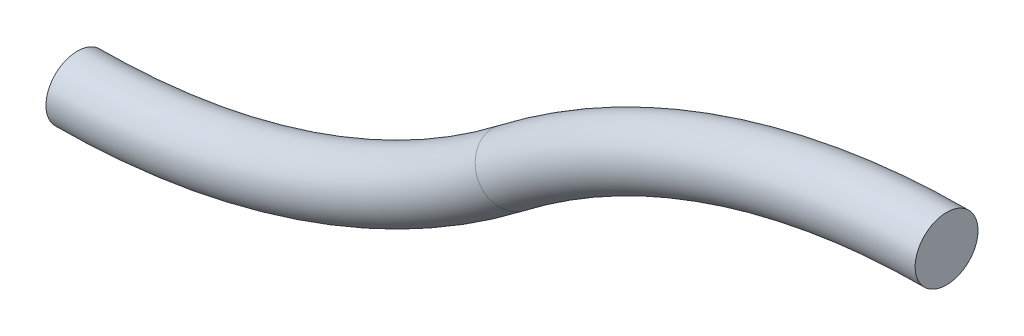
ISO-10303-21;
HEADER;
FILE_DESCRIPTION(('STEP AP214'),'2;1');
FILE_NAME('part.step','',(''),(''),'','','');
FILE_SCHEMA(('AUTOMOTIVE_DESIGN { 1 0 10303 214 1 1 1 1 }'));
ENDSEC;
DATA;
#1=APPLICATION_CONTEXT('core data for automotive mechanical design processes');
#2=APPLICATION_PROTOCOL_DEFINITION('international standard','automotive_design',2000,#1);
#3=PRODUCT_CONTEXT('',#1,'mechanical');
#4=PRODUCT('Part','Part','',(#3));
#5=PRODUCT_RELATED_PRODUCT_CATEGORY('part','',(#4));
#6=PRODUCT_DEFINITION_FORMATION('','',#4);
#7=PRODUCT_DEFINITION_CONTEXT('part definition',#1,'design');
#8=PRODUCT_DEFINITION('design','',#6,#7);
#9=PRODUCT_DEFINITION_SHAPE('','',#8);
#10=(LENGTH_UNIT() NAMED_UNIT(*) SI_UNIT(.MILLI.,.METRE.));
#11=(NAMED_UNIT(*) PLANE_ANGLE_UNIT() SI_UNIT($,.RADIAN.));
#12=(NAMED_UNIT(*) SI_UNIT($,.STERADIAN.) SOLID_ANGLE_UNIT());
#13=UNCERTAINTY_MEASURE_WITH_UNIT(LENGTH_MEASURE(1.E-05),#10,'distance_accuracy_value','');
#14=(GEOMETRIC_REPRESENTATION_CONTEXT(3) GLOBAL_UNCERTAINTY_ASSIGNED_CONTEXT((#13)) GLOBAL_UNIT_ASSIGNED_CONTEXT((#10,
#11,#12)) REPRESENTATION_CONTEXT('',''));
#15=CARTESIAN_POINT('',(0.,0.,0.));
#16=DIRECTION('',(0.,0.,1.));
#17=DIRECTION('',(1.,0.,0.));
#18=AXIS2_PLACEMENT_3D('',#15,#16,#17);
#19=CARTESIAN_POINT('',(109.7026,-52.9228681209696,0.));
#20=DIRECTION('',(0.,0.,-1.));
#21=DIRECTION('',(-1.,0.,0.));
#22=AXIS2_PLACEMENT_3D('',#19,#20,#21);
#23=TOROIDAL_SURFACE('',#22,90.1417615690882,3.96875);
#24=CARTESIAN_POINT('',(54.8513000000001,18.6094467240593,0.));
#25=DIRECTION('',(0.793553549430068,0.608500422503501,0.));
#26=DIRECTION('',(0.,0.,-1.));
#27=AXIS2_PLACEMENT_3D('',#24,#25,#26);
#28=CIRCLE('',#27,3.96875);
#29=CARTESIAN_POINT('',(52.4363139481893,21.7588623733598,0.));
#30=VERTEX_POINT('',#29);
#31=EDGE_CURVE('E34',#30,#30,#28,.T.);
#32=CARTESIAN_POINT('',(109.7026,37.2188934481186,0.));
#33=DIRECTION('',(1.,0.,0.));
#34=DIRECTION('',(0.,0.,-1.));
#35=AXIS2_PLACEMENT_3D('',#32,#33,#34);
#36=CIRCLE('',#35,3.96875);
#37=CARTESIAN_POINT('',(109.7026,41.1876434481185,0.));
#38=VERTEX_POINT('',#37);
#39=EDGE_CURVE('E10',#38,#38,#36,.T.);
#40=CARTESIAN_POINT('',(109.7026,-52.9228681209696,0.));
#41=DIRECTION('',(0.,0.,-1.));
#42=DIRECTION('',(-1.,0.,0.));
#43=AXIS2_PLACEMENT_3D('',#40,#41,#42);
#44=CIRCLE('',#43,94.1105115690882);
#45=EDGE_CURVE('',#30,#38,#44,.T.);
#46=ORIENTED_EDGE('',*,*,#31,.T.);
#47=ORIENTED_EDGE('',*,*,#39,.F.);
#48=ORIENTED_EDGE('',*,*,#45,.T.);
#49=ORIENTED_EDGE('',*,*,#45,.F.);
#50=EDGE_LOOP('',(#46,#48,#47,#49));
#51=FACE_BOUND('',#50,.T.);
#52=ADVANCED_FACE('F28',(#51),#23,.T.);
#53=CARTESIAN_POINT('',(0.,90.1417615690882,-1.07552855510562E-13));
#54=DIRECTION('',(0.,0.,-1.));
#55=DIRECTION('',(-1.,0.,0.));
#56=AXIS2_PLACEMENT_3D('',#53,#54,#55);
#57=TOROIDAL_SURFACE('',#56,90.1417615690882,3.96875);
#58=ORIENTED_EDGE('',*,*,#31,.F.);
#59=EDGE_LOOP('',(#58));
#60=FACE_BOUND('',#59,.T.);
#61=CARTESIAN_POINT('',(0.,0.,0.));
#62=DIRECTION('',(1.,0.,0.));
#63=DIRECTION('',(0.,0.,-1.));
#64=AXIS2_PLACEMENT_3D('',#61,#62,#63);
#65=CIRCLE('',#64,3.96875);
#66=CARTESIAN_POINT('',(0.,0.,-3.96875));
#67=VERTEX_POINT('',#66);
#68=EDGE_CURVE('E38',#67,#67,#65,.T.);
#69=ORIENTED_EDGE('',*,*,#68,.T.);
#70=EDGE_LOOP('',(#69));
#71=FACE_BOUND('',#70,.T.);
#72=ADVANCED_FACE('F45',(#60,#71),#57,.T.);
#73=CARTESIAN_POINT('',(109.7026,37.2188934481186,0.));
#74=DIRECTION('',(1.,0.,0.));
#75=DIRECTION('',(0.,0.,-1.));
#76=AXIS2_PLACEMENT_3D('',#73,#74,#75);
#77=PLANE('',#76);
#78=ORIENTED_EDGE('',*,*,#39,.T.);
#79=EDGE_LOOP('',(#78));
#80=FACE_BOUND('',#79,.T.);
#81=ADVANCED_FACE('F49',(#80),#77,.T.);
#82=CARTESIAN_POINT('',(0.,0.,0.));
#83=DIRECTION('',(1.,0.,0.));
#84=DIRECTION('',(0.,0.,-1.));
#85=AXIS2_PLACEMENT_3D('',#82,#83,#84);
#86=PLANE('',#85);
#87=ORIENTED_EDGE('',*,*,#68,.F.);
#88=EDGE_LOOP('',(#87));
#89=FACE_BOUND('',#88,.T.);
#90=ADVANCED_FACE('F47',(#89),#86,.F.);
#91=CLOSED_SHELL('',(#52,#72,#81,#90));
#92=MANIFOLD_SOLID_BREP('B2',#91);
#93=ADVANCED_BREP_SHAPE_REPRESENTATION('',(#18,#92),#14);
#94=SHAPE_DEFINITION_REPRESENTATION(#9,#93);
ENDSEC;
END-ISO-10303-21;
